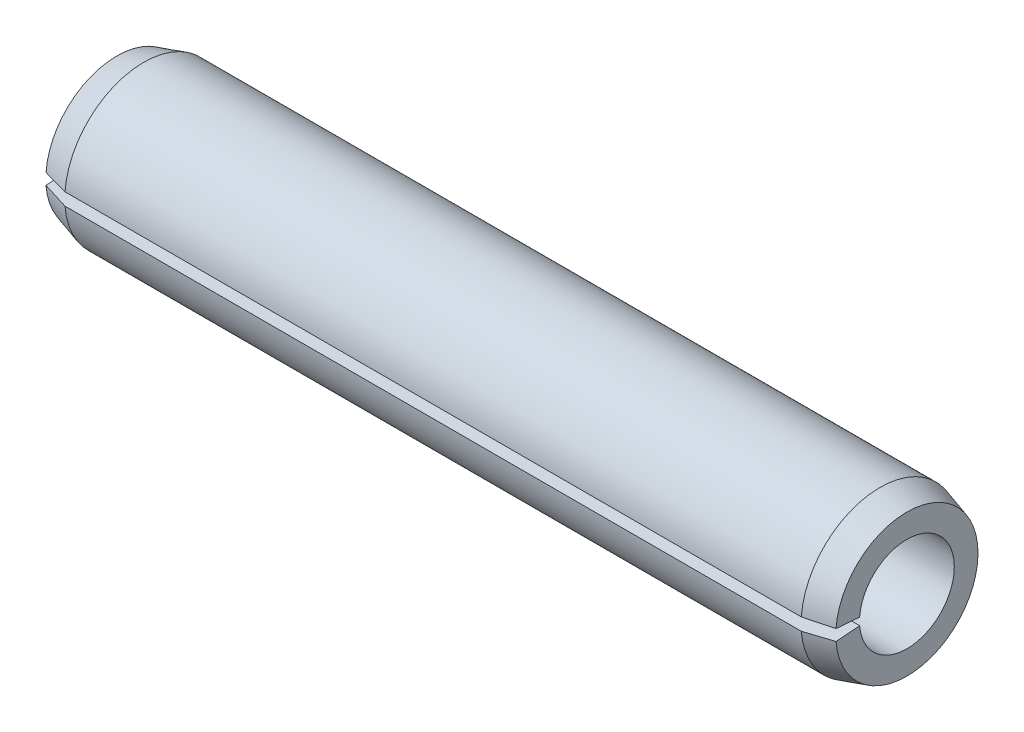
from build123d import *

# Parameters (mm, degrees)
GAP_DEPTH = 101.995049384


with BuildPart() as part:
    # Sketch1 → Base-Revolve (revolve)
    with BuildSketch(Plane.XY, mode=Mode.PRIVATE) as base_revolve_sk:
        Polygon((0, 6), (100, 6), (100, 9), (96.6, 10), (3.4, 10), (0, 9), align=None)
    revolve(base_revolve_sk.sketch.rotate(Axis((-9.525, 0, 0), (1, 0, 0)), 90), axis=Axis((-9.525, 0, 0), (1, 0, 0)))

    # Sketch2 → Gap (cut, through all)
    with BuildSketch(Plane(origin=(0, 0, 0), x_dir=(0, -1, 0), z_dir=(-1, 0, 0))):
        with BuildLine():
            Line((0, 0), (0.800282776, 10.168556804))
            ThreePointArc((0.800282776, 10.168556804), (0, 10.2), (-0.800282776, 10.168556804))
            Line((-0.800282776, 10.168556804), (0, 0))
        make_face()
    extrude(amount=-GAP_DEPTH, mode=Mode.SUBTRACT)


solid = part.part
